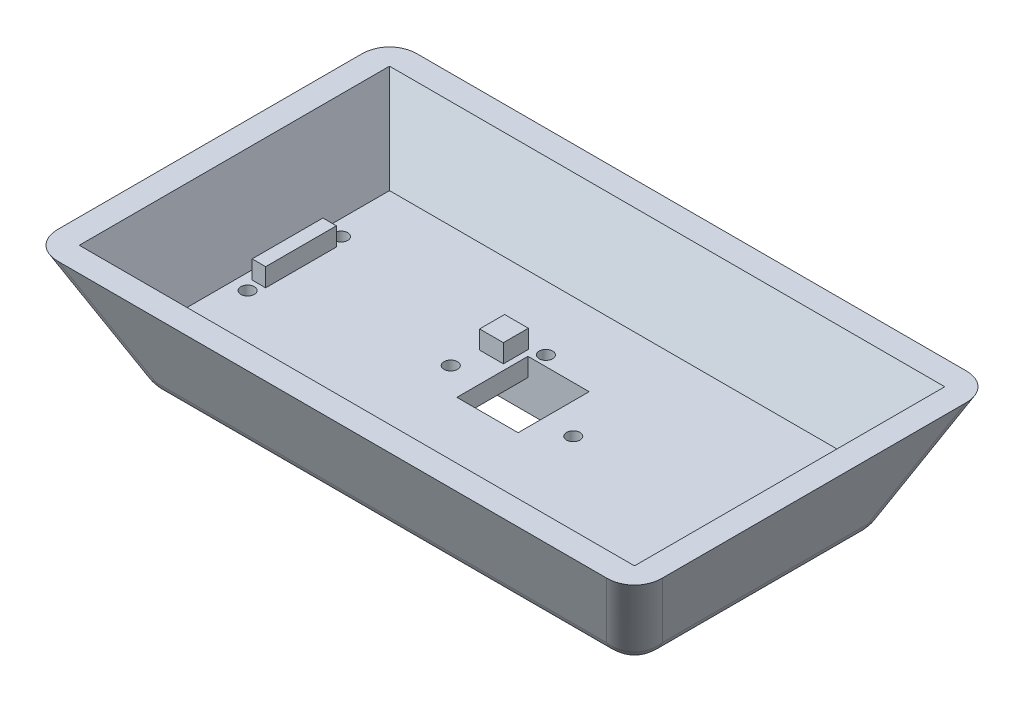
ISO-10303-21;
HEADER;
FILE_DESCRIPTION(('STEP AP214'),'2;1');
FILE_NAME('part.step','',(''),(''),'','','');
FILE_SCHEMA(('AUTOMOTIVE_DESIGN { 1 0 10303 214 1 1 1 1 }'));
ENDSEC;
DATA;
#1=APPLICATION_CONTEXT('core data for automotive mechanical design processes');
#2=APPLICATION_PROTOCOL_DEFINITION('international standard','automotive_design',2000,#1);
#3=PRODUCT_CONTEXT('',#1,'mechanical');
#4=PRODUCT('Part','Part','',(#3));
#5=PRODUCT_RELATED_PRODUCT_CATEGORY('part','',(#4));
#6=PRODUCT_DEFINITION_FORMATION('','',#4);
#7=PRODUCT_DEFINITION_CONTEXT('part definition',#1,'design');
#8=PRODUCT_DEFINITION('design','',#6,#7);
#9=PRODUCT_DEFINITION_SHAPE('','',#8);
#10=(LENGTH_UNIT() NAMED_UNIT(*) SI_UNIT(.MILLI.,.METRE.));
#11=(NAMED_UNIT(*) PLANE_ANGLE_UNIT() SI_UNIT($,.RADIAN.));
#12=(NAMED_UNIT(*) SI_UNIT($,.STERADIAN.) SOLID_ANGLE_UNIT());
#13=UNCERTAINTY_MEASURE_WITH_UNIT(LENGTH_MEASURE(1.E-05),#10,'distance_accuracy_value','');
#14=(GEOMETRIC_REPRESENTATION_CONTEXT(3) GLOBAL_UNCERTAINTY_ASSIGNED_CONTEXT((#13)) GLOBAL_UNIT_ASSIGNED_CONTEXT((#10,
#11,#12)) REPRESENTATION_CONTEXT('',''));
#15=CARTESIAN_POINT('',(0.,0.,0.));
#16=DIRECTION('',(0.,0.,1.));
#17=DIRECTION('',(1.,0.,0.));
#18=AXIS2_PLACEMENT_3D('',#15,#16,#17);
#19=CARTESIAN_POINT('',(0.,8.,0.));
#20=DIRECTION('',(0.,1.,0.));
#21=DIRECTION('',(0.,0.,1.));
#22=AXIS2_PLACEMENT_3D('',#19,#20,#21);
#23=PLANE('',#22);
#24=CARTESIAN_POINT('',(-3.73046126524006,8.,-9.26999999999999));
#25=DIRECTION('',(0.,1.,0.));
#26=DIRECTION('',(0.,0.,1.));
#27=AXIS2_PLACEMENT_3D('',#24,#25,#26);
#28=CIRCLE('',#27,1.1);
#29=CARTESIAN_POINT('',(-3.73046126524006,8.,-8.16999999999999));
#30=VERTEX_POINT('',#29);
#31=EDGE_CURVE('E307',#30,#30,#28,.T.);
#32=ORIENTED_EDGE('',*,*,#31,.F.);
#33=EDGE_LOOP('',(#32));
#34=FACE_BOUND('',#33,.T.);
#35=CARTESIAN_POINT('',(-37.19046126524,8.,5.98000000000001));
#36=DIRECTION('',(0.,1.,0.));
#37=DIRECTION('',(0.,0.,1.));
#38=AXIS2_PLACEMENT_3D('',#35,#36,#37);
#39=CIRCLE('',#38,1.1);
#40=CARTESIAN_POINT('',(-37.19046126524,8.,7.08));
#41=VERTEX_POINT('',#40);
#42=EDGE_CURVE('E300',#41,#41,#39,.T.);
#43=ORIENTED_EDGE('',*,*,#42,.F.);
#44=EDGE_LOOP('',(#43));
#45=FACE_BOUND('',#44,.T.);
#46=CARTESIAN_POINT('',(-37.1904612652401,8.,-9.26999999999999));
#47=DIRECTION('',(0.,1.,0.));
#48=DIRECTION('',(0.,0.,1.));
#49=AXIS2_PLACEMENT_3D('',#46,#47,#48);
#50=CIRCLE('',#49,1.1);
#51=CARTESIAN_POINT('',(-37.1904612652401,8.,-8.16999999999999));
#52=VERTEX_POINT('',#51);
#53=EDGE_CURVE('E303',#52,#52,#50,.T.);
#54=ORIENTED_EDGE('',*,*,#53,.F.);
#55=EDGE_LOOP('',(#54));
#56=FACE_BOUND('',#55,.T.);
#57=CARTESIAN_POINT('',(-10.,8.,0.));
#58=DIRECTION('',(0.,1.,0.));
#59=DIRECTION('',(0.,0.,1.));
#60=AXIS2_PLACEMENT_3D('',#57,#58,#59);
#61=CIRCLE('',#60,1.1);
#62=CARTESIAN_POINT('',(-10.,8.,1.1));
#63=VERTEX_POINT('',#62);
#64=EDGE_CURVE('E322',#63,#63,#61,.F.);
#65=ORIENTED_EDGE('',*,*,#64,.T.);
#66=EDGE_LOOP('',(#65));
#67=FACE_BOUND('',#66,.T.);
#68=CARTESIAN_POINT('',(10.,8.,0.));
#69=DIRECTION('',(0.,1.,0.));
#70=DIRECTION('',(0.,0.,1.));
#71=AXIS2_PLACEMENT_3D('',#68,#69,#70);
#72=CIRCLE('',#71,1.1);
#73=CARTESIAN_POINT('',(10.,8.,1.1));
#74=VERTEX_POINT('',#73);
#75=EDGE_CURVE('E325',#74,#74,#72,.F.);
#76=ORIENTED_EDGE('',*,*,#75,.T.);
#77=EDGE_LOOP('',(#76));
#78=FACE_BOUND('',#77,.T.);
#79=DIRECTION('',(0.,0.,-1.));
#80=VECTOR('',#79,1.);
#81=CARTESIAN_POINT('',(-5.,8.,4.));
#82=LINE('',#81,#80);
#83=CARTESIAN_POINT('',(-5.,8.,4.));
#84=VERTEX_POINT('',#83);
#85=CARTESIAN_POINT('',(-5.,8.,-7.6));
#86=VERTEX_POINT('',#85);
#87=EDGE_CURVE('E351',#84,#86,#82,.T.);
#88=ORIENTED_EDGE('',*,*,#87,.T.);
#89=DIRECTION('',(1.,0.,0.));
#90=VECTOR('',#89,1.);
#91=CARTESIAN_POINT('',(5.,8.,-7.6));
#92=LINE('',#91,#90);
#93=CARTESIAN_POINT('',(5.,8.,-7.6));
#94=VERTEX_POINT('',#93);
#95=EDGE_CURVE('E315',#86,#94,#92,.T.);
#96=ORIENTED_EDGE('',*,*,#95,.T.);
#97=DIRECTION('',(0.,0.,1.));
#98=VECTOR('',#97,1.);
#99=CARTESIAN_POINT('',(5.,8.,4.));
#100=LINE('',#99,#98);
#101=CARTESIAN_POINT('',(5.,8.,4.));
#102=VERTEX_POINT('',#101);
#103=EDGE_CURVE('E331',#94,#102,#100,.T.);
#104=ORIENTED_EDGE('',*,*,#103,.T.);
#105=DIRECTION('',(-1.,0.,0.));
#106=VECTOR('',#105,1.);
#107=CARTESIAN_POINT('',(5.,8.,4.));
#108=LINE('',#107,#106);
#109=EDGE_CURVE('E354',#102,#84,#108,.T.);
#110=ORIENTED_EDGE('',*,*,#109,.T.);
#111=EDGE_LOOP('',(#88,#96,#104,#110));
#112=FACE_BOUND('',#111,.T.);
#113=DIRECTION('',(-1.,0.,0.));
#114=VECTOR('',#113,1.);
#115=CARTESIAN_POINT('',(0.,8.,-19.73046126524));
#116=LINE('',#115,#114);
#117=CARTESIAN_POINT('',(39.73046126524,8.,-19.73046126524));
#118=VERTEX_POINT('',#117);
#119=CARTESIAN_POINT('',(-39.73046126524,8.,-19.73046126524));
#120=VERTEX_POINT('',#119);
#121=EDGE_CURVE('E369',#118,#120,#116,.T.);
#122=ORIENTED_EDGE('',*,*,#121,.T.);
#123=DIRECTION('',(0.,0.,1.));
#124=VECTOR('',#123,1.);
#125=CARTESIAN_POINT('',(-39.73046126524,8.,0.));
#126=LINE('',#125,#124);
#127=CARTESIAN_POINT('',(-39.73046126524,8.,19.73046126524));
#128=VERTEX_POINT('',#127);
#129=EDGE_CURVE('E383',#120,#128,#126,.T.);
#130=ORIENTED_EDGE('',*,*,#129,.T.);
#131=DIRECTION('',(1.,0.,0.));
#132=VECTOR('',#131,1.);
#133=CARTESIAN_POINT('',(0.,8.,19.73046126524));
#134=LINE('',#133,#132);
#135=CARTESIAN_POINT('',(39.73046126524,8.,19.73046126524));
#136=VERTEX_POINT('',#135);
#137=EDGE_CURVE('E386',#128,#136,#134,.T.);
#138=ORIENTED_EDGE('',*,*,#137,.T.);
#139=DIRECTION('',(0.,0.,-1.));
#140=VECTOR('',#139,1.);
#141=CARTESIAN_POINT('',(39.73046126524,8.,0.));
#142=LINE('',#141,#140);
#143=EDGE_CURVE('E378',#136,#118,#142,.T.);
#144=ORIENTED_EDGE('',*,*,#143,.T.);
#145=EDGE_LOOP('',(#122,#130,#138,#144));
#146=FACE_BOUND('',#145,.T.);
#147=DIRECTION('',(1.,0.,0.));
#148=VECTOR('',#147,1.);
#149=CARTESIAN_POINT('',(-38.29046126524,8.,4.13000000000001));
#150=LINE('',#149,#148);
#151=CARTESIAN_POINT('',(-38.29046126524,8.,4.13000000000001));
#152=VERTEX_POINT('',#151);
#153=CARTESIAN_POINT('',(-36.09046126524,8.,4.13000000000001));
#154=VERTEX_POINT('',#153);
#155=EDGE_CURVE('E263',#152,#154,#150,.T.);
#156=ORIENTED_EDGE('',*,*,#155,.F.);
#157=DIRECTION('',(0.,0.,1.));
#158=VECTOR('',#157,1.);
#159=CARTESIAN_POINT('',(-38.29046126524,8.,-7.41999999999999));
#160=LINE('',#159,#158);
#161=CARTESIAN_POINT('',(-38.29046126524,8.,-7.41999999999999));
#162=VERTEX_POINT('',#161);
#163=EDGE_CURVE('E260',#162,#152,#160,.T.);
#164=ORIENTED_EDGE('',*,*,#163,.F.);
#165=DIRECTION('',(-1.,0.,0.));
#166=VECTOR('',#165,1.);
#167=CARTESIAN_POINT('',(-38.29046126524,8.,-7.41999999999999));
#168=LINE('',#167,#166);
#169=CARTESIAN_POINT('',(-36.09046126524,8.,-7.41999999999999));
#170=VERTEX_POINT('',#169);
#171=EDGE_CURVE('E278',#170,#162,#168,.T.);
#172=ORIENTED_EDGE('',*,*,#171,.F.);
#173=DIRECTION('',(0.,0.,-1.));
#174=VECTOR('',#173,1.);
#175=CARTESIAN_POINT('',(-36.09046126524,8.,-7.41999999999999));
#176=LINE('',#175,#174);
#177=EDGE_CURVE('E286',#154,#170,#176,.T.);
#178=ORIENTED_EDGE('',*,*,#177,.F.);
#179=EDGE_LOOP('',(#156,#164,#172,#178));
#180=FACE_BOUND('',#179,.T.);
#181=DIRECTION('',(1.,0.,0.));
#182=VECTOR('',#181,1.);
#183=CARTESIAN_POINT('',(-9.81764741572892,8.,-4.53001605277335));
#184=LINE('',#183,#182);
#185=CARTESIAN_POINT('',(-9.81764741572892,8.,-4.53001605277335));
#186=VERTEX_POINT('',#185);
#187=CARTESIAN_POINT('',(-5.93586739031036,8.,-4.53001605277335));
#188=VERTEX_POINT('',#187);
#189=EDGE_CURVE('E259',#186,#188,#184,.T.);
#190=ORIENTED_EDGE('',*,*,#189,.F.);
#191=DIRECTION('',(0.,0.,1.));
#192=VECTOR('',#191,1.);
#193=CARTESIAN_POINT('',(-9.81764741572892,8.,-8.60917472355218));
#194=LINE('',#193,#192);
#195=CARTESIAN_POINT('',(-9.81764741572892,8.,-8.60917472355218));
#196=VERTEX_POINT('',#195);
#197=EDGE_CURVE('E254',#196,#186,#194,.T.);
#198=ORIENTED_EDGE('',*,*,#197,.F.);
#199=DIRECTION('',(-1.,0.,0.));
#200=VECTOR('',#199,1.);
#201=CARTESIAN_POINT('',(-9.81764741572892,8.,-8.60917472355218));
#202=LINE('',#201,#200);
#203=CARTESIAN_POINT('',(-5.93586739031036,8.,-8.60917472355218));
#204=VERTEX_POINT('',#203);
#205=EDGE_CURVE('E235',#204,#196,#202,.T.);
#206=ORIENTED_EDGE('',*,*,#205,.F.);
#207=DIRECTION('',(0.,0.,-1.));
#208=VECTOR('',#207,1.);
#209=CARTESIAN_POINT('',(-5.93586739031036,8.,-8.60917472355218));
#210=LINE('',#209,#208);
#211=EDGE_CURVE('E247',#188,#204,#210,.T.);
#212=ORIENTED_EDGE('',*,*,#211,.F.);
#213=EDGE_LOOP('',(#190,#198,#206,#212));
#214=FACE_BOUND('',#213,.T.);
#215=ADVANCED_FACE('F37',(#34,#45,#56,#67,#78,#112,#146,#180,#214),#23,.T.);
#216=CARTESIAN_POINT('',(40.,0.,-20.));
#217=DIRECTION('',(0.90630778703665,-0.4226182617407,0.));
#218=DIRECTION('',(0.4226182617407,0.90630778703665,0.));
#219=AXIS2_PLACEMENT_3D('',#216,#217,#218);
#220=PLANE('',#219);
#221=DIRECTION('',(0.,0.,1.));
#222=VECTOR('',#221,1.);
#223=CARTESIAN_POINT('',(49.3261531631,20.,-20.));
#224=LINE('',#223,#222);
#225=CARTESIAN_POINT('',(49.3261531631,20.,24.7946142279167));
#226=VERTEX_POINT('',#225);
#227=CARTESIAN_POINT('',(49.3261531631,20.,-24.7946142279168));
#228=VERTEX_POINT('',#227);
#229=EDGE_CURVE('E417',#226,#228,#224,.F.);
#230=ORIENTED_EDGE('',*,*,#229,.F.);
#231=DIRECTION('',(0.389281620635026,0.834817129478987,0.389281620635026));
#232=VECTOR('',#231,1.);
#233=CARTESIAN_POINT('',(34.6251030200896,-11.5265037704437,10.0935640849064));
#234=LINE('',#233,#232);
#235=CARTESIAN_POINT('',(41.3461876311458,2.8869086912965,16.8146486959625));
#236=VERTEX_POINT('',#235);
#237=EDGE_CURVE('E461',#226,#236,#234,.F.);
#238=ORIENTED_EDGE('',*,*,#237,.T.);
#239=DIRECTION('',(0.,0.,-1.));
#240=VECTOR('',#239,1.);
#241=CARTESIAN_POINT('',(41.3461876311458,2.8869086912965,-20.));
#242=LINE('',#241,#240);
#243=CARTESIAN_POINT('',(41.3461876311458,2.8869086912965,-16.8146486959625));
#244=VERTEX_POINT('',#243);
#245=EDGE_CURVE('E459',#236,#244,#242,.T.);
#246=ORIENTED_EDGE('',*,*,#245,.T.);
#247=DIRECTION('',(0.389281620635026,0.834817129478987,-0.389281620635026));
#248=VECTOR('',#247,1.);
#249=CARTESIAN_POINT('',(40.6867102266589,1.4726548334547,-16.1551712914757));
#250=LINE('',#249,#248);
#251=EDGE_CURVE('E457',#244,#228,#250,.T.);
#252=ORIENTED_EDGE('',*,*,#251,.T.);
#253=EDGE_LOOP('',(#230,#238,#246,#252));
#254=FACE_BOUND('',#253,.T.);
#255=ADVANCED_FACE('F530',(#254),#220,.T.);
#256=CARTESIAN_POINT('',(-40.,0.,-20.));
#257=DIRECTION('',(0.,-0.4226182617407,-0.90630778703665));
#258=DIRECTION('',(0.,0.90630778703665,-0.4226182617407));
#259=AXIS2_PLACEMENT_3D('',#256,#257,#258);
#260=PLANE('',#259);
#261=DIRECTION('',(1.,0.,0.));
#262=VECTOR('',#261,1.);
#263=CARTESIAN_POINT('',(-40.,20.,-29.3261531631));
#264=LINE('',#263,#262);
#265=CARTESIAN_POINT('',(44.7946142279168,20.,-29.3261531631));
#266=VERTEX_POINT('',#265);
#267=CARTESIAN_POINT('',(-44.7946142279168,20.,-29.3261531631));
#268=VERTEX_POINT('',#267);
#269=EDGE_CURVE('E426',#266,#268,#264,.F.);
#270=ORIENTED_EDGE('',*,*,#269,.F.);
#271=DIRECTION('',(0.389281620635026,0.834817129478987,-0.389281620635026));
#272=VECTOR('',#271,1.);
#273=CARTESIAN_POINT('',(24.0319568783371,-24.5256623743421,-8.56349581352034));
#274=LINE('',#273,#272);
#275=CARTESIAN_POINT('',(36.8146486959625,2.8869086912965,-21.3461876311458));
#276=VERTEX_POINT('',#275);
#277=EDGE_CURVE('E54',#266,#276,#274,.F.);
#278=ORIENTED_EDGE('',*,*,#277,.T.);
#279=DIRECTION('',(-1.,0.,0.));
#280=VECTOR('',#279,1.);
#281=CARTESIAN_POINT('',(-40.,2.8869086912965,-21.3461876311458));
#282=LINE('',#281,#280);
#283=CARTESIAN_POINT('',(-36.8146486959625,2.8869086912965,-21.3461876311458));
#284=VERTEX_POINT('',#283);
#285=EDGE_CURVE('E59',#276,#284,#282,.T.);
#286=ORIENTED_EDGE('',*,*,#285,.T.);
#287=DIRECTION('',(-0.389281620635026,0.834817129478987,-0.389281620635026));
#288=VECTOR('',#287,1.);
#289=CARTESIAN_POINT('',(-36.1551712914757,1.4726548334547,-20.6867102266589));
#290=LINE('',#289,#288);
#291=EDGE_CURVE('E463',#284,#268,#290,.T.);
#292=ORIENTED_EDGE('',*,*,#291,.T.);
#293=EDGE_LOOP('',(#270,#278,#286,#292));
#294=FACE_BOUND('',#293,.T.);
#295=ADVANCED_FACE('F537',(#294),#260,.T.);
#296=CARTESIAN_POINT('',(-40.,0.,-20.));
#297=DIRECTION('',(-0.90630778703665,-0.4226182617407,0.));
#298=DIRECTION('',(0.4226182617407,-0.90630778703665,0.));
#299=AXIS2_PLACEMENT_3D('',#296,#297,#298);
#300=PLANE('',#299);
#301=DIRECTION('',(0.,0.,1.));
#302=VECTOR('',#301,1.);
#303=CARTESIAN_POINT('',(-41.3461876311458,2.8869086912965,-20.));
#304=LINE('',#303,#302);
#305=CARTESIAN_POINT('',(-41.3461876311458,2.8869086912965,-16.8146486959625));
#306=VERTEX_POINT('',#305);
#307=CARTESIAN_POINT('',(-41.3461876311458,2.8869086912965,16.8146486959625));
#308=VERTEX_POINT('',#307);
#309=EDGE_CURVE('E437',#306,#308,#304,.T.);
#310=ORIENTED_EDGE('',*,*,#309,.T.);
#311=DIRECTION('',(-0.389281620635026,0.834817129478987,0.389281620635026));
#312=VECTOR('',#311,1.);
#313=CARTESIAN_POINT('',(-34.6251030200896,-11.5265037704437,10.0935640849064));
#314=LINE('',#313,#312);
#315=CARTESIAN_POINT('',(-49.3261531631,20.,24.7946142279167));
#316=VERTEX_POINT('',#315);
#317=EDGE_CURVE('E440',#308,#316,#314,.T.);
#318=ORIENTED_EDGE('',*,*,#317,.T.);
#319=DIRECTION('',(0.,0.,-1.));
#320=VECTOR('',#319,1.);
#321=CARTESIAN_POINT('',(-49.3261531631,20.,-20.));
#322=LINE('',#321,#320);
#323=CARTESIAN_POINT('',(-49.3261531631,20.,-24.7946142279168));
#324=VERTEX_POINT('',#323);
#325=EDGE_CURVE('E429',#324,#316,#322,.F.);
#326=ORIENTED_EDGE('',*,*,#325,.F.);
#327=DIRECTION('',(-0.389281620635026,0.834817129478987,-0.389281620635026));
#328=VECTOR('',#327,1.);
#329=CARTESIAN_POINT('',(-40.6867102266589,1.4726548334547,-16.1551712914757));
#330=LINE('',#329,#328);
#331=EDGE_CURVE('E435',#324,#306,#330,.F.);
#332=ORIENTED_EDGE('',*,*,#331,.T.);
#333=EDGE_LOOP('',(#310,#318,#326,#332));
#334=FACE_BOUND('',#333,.T.);
#335=ADVANCED_FACE('F594',(#334),#300,.T.);
#336=CARTESIAN_POINT('',(-40.,0.,20.));
#337=DIRECTION('',(0.,-0.4226182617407,0.90630778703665));
#338=DIRECTION('',(0.,-0.90630778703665,-0.4226182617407));
#339=AXIS2_PLACEMENT_3D('',#336,#337,#338);
#340=PLANE('',#339);
#341=DIRECTION('',(-1.,0.,0.));
#342=VECTOR('',#341,1.);
#343=CARTESIAN_POINT('',(-40.,20.,29.3261531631));
#344=LINE('',#343,#342);
#345=CARTESIAN_POINT('',(-44.7946142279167,20.,29.3261531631));
#346=VERTEX_POINT('',#345);
#347=CARTESIAN_POINT('',(44.7946142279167,20.,29.3261531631));
#348=VERTEX_POINT('',#347);
#349=EDGE_CURVE('E432',#346,#348,#344,.F.);
#350=ORIENTED_EDGE('',*,*,#349,.F.);
#351=DIRECTION('',(-0.389281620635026,0.834817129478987,0.389281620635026));
#352=VECTOR('',#351,1.);
#353=CARTESIAN_POINT('',(-36.1551712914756,1.4726548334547,20.6867102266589));
#354=LINE('',#353,#352);
#355=CARTESIAN_POINT('',(-36.8146486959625,2.8869086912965,21.3461876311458));
#356=VERTEX_POINT('',#355);
#357=EDGE_CURVE('E455',#346,#356,#354,.F.);
#358=ORIENTED_EDGE('',*,*,#357,.T.);
#359=DIRECTION('',(1.,0.,0.));
#360=VECTOR('',#359,1.);
#361=CARTESIAN_POINT('',(-40.,2.8869086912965,21.3461876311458));
#362=LINE('',#361,#360);
#363=CARTESIAN_POINT('',(36.8146486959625,2.8869086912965,21.3461876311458));
#364=VERTEX_POINT('',#363);
#365=EDGE_CURVE('E453',#356,#364,#362,.T.);
#366=ORIENTED_EDGE('',*,*,#365,.T.);
#367=DIRECTION('',(0.389281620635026,0.834817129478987,0.389281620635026));
#368=VECTOR('',#367,1.);
#369=CARTESIAN_POINT('',(24.0319568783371,-24.5256623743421,8.56349581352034));
#370=LINE('',#369,#368);
#371=EDGE_CURVE('E451',#364,#348,#370,.T.);
#372=ORIENTED_EDGE('',*,*,#371,.T.);
#373=EDGE_LOOP('',(#350,#358,#366,#372));
#374=FACE_BOUND('',#373,.T.);
#375=ADVANCED_FACE('F587',(#374),#340,.T.);
#376=CARTESIAN_POINT('',(0.,20.,0.));
#377=DIRECTION('',(0.,1.,0.));
#378=DIRECTION('',(0.,0.,1.));
#379=AXIS2_PLACEMENT_3D('',#376,#377,#378);
#380=PLANE('',#379);
#381=DIRECTION('',(-1.,0.,0.));
#382=VECTOR('',#381,1.);
#383=CARTESIAN_POINT('',(45.3261531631,20.,-25.3261531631));
#384=LINE('',#383,#382);
#385=CARTESIAN_POINT('',(45.3261531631,20.,-25.3261531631));
#386=VERTEX_POINT('',#385);
#387=CARTESIAN_POINT('',(-45.3261531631,20.,-25.3261531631));
#388=VERTEX_POINT('',#387);
#389=EDGE_CURVE('E321',#386,#388,#384,.T.);
#390=ORIENTED_EDGE('',*,*,#389,.F.);
#391=DIRECTION('',(0.,0.,-1.));
#392=VECTOR('',#391,1.);
#393=CARTESIAN_POINT('',(45.3261531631,20.,25.3261531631));
#394=LINE('',#393,#392);
#395=CARTESIAN_POINT('',(45.3261531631,20.,25.3261531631));
#396=VERTEX_POINT('',#395);
#397=EDGE_CURVE('E366',#396,#386,#394,.T.);
#398=ORIENTED_EDGE('',*,*,#397,.F.);
#399=DIRECTION('',(1.,0.,0.));
#400=VECTOR('',#399,1.);
#401=CARTESIAN_POINT('',(-45.3261531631,20.,25.3261531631));
#402=LINE('',#401,#400);
#403=CARTESIAN_POINT('',(-45.3261531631,20.,25.3261531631));
#404=VERTEX_POINT('',#403);
#405=EDGE_CURVE('E363',#404,#396,#402,.T.);
#406=ORIENTED_EDGE('',*,*,#405,.F.);
#407=DIRECTION('',(0.,0.,1.));
#408=VECTOR('',#407,1.);
#409=CARTESIAN_POINT('',(-45.3261531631,20.,-25.3261531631));
#410=LINE('',#409,#408);
#411=EDGE_CURVE('E360',#388,#404,#410,.T.);
#412=ORIENTED_EDGE('',*,*,#411,.F.);
#413=EDGE_LOOP('',(#390,#398,#406,#412));
#414=FACE_BOUND('',#413,.T.);
#415=ORIENTED_EDGE('',*,*,#325,.T.);
#416=CARTESIAN_POINT('',(-43.8092635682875,20.,23.8092635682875));
#417=DIRECTION('',(0.,1.,0.));
#418=DIRECTION('',(0.707106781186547,0.,-0.707106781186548));
#419=AXIS2_PLACEMENT_3D('',#416,#417,#418);
#420=ELLIPSE('',#419,5.98933565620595,5.);
#421=EDGE_CURVE('E11',#316,#346,#420,.T.);
#422=ORIENTED_EDGE('',*,*,#421,.T.);
#423=ORIENTED_EDGE('',*,*,#349,.T.);
#424=CARTESIAN_POINT('',(43.8092635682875,20.,23.8092635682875));
#425=DIRECTION('',(0.,1.,0.));
#426=DIRECTION('',(-0.707106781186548,0.,-0.707106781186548));
#427=AXIS2_PLACEMENT_3D('',#424,#425,#426);
#428=ELLIPSE('',#427,5.98933565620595,5.);
#429=EDGE_CURVE('E46',#348,#226,#428,.T.);
#430=ORIENTED_EDGE('',*,*,#429,.T.);
#431=ORIENTED_EDGE('',*,*,#229,.T.);
#432=CARTESIAN_POINT('',(43.8092635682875,20.,-23.8092635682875));
#433=DIRECTION('',(0.,1.,0.));
#434=DIRECTION('',(-0.707106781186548,0.,0.707106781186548));
#435=AXIS2_PLACEMENT_3D('',#432,#433,#434);
#436=ELLIPSE('',#435,5.98933565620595,5.);
#437=EDGE_CURVE('E469',#228,#266,#436,.T.);
#438=ORIENTED_EDGE('',*,*,#437,.T.);
#439=ORIENTED_EDGE('',*,*,#269,.T.);
#440=CARTESIAN_POINT('',(-43.8092635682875,20.,-23.8092635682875));
#441=DIRECTION('',(0.,1.,0.));
#442=DIRECTION('',(0.707106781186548,0.,0.707106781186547));
#443=AXIS2_PLACEMENT_3D('',#440,#441,#442);
#444=ELLIPSE('',#443,5.98933565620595,5.);
#445=EDGE_CURVE('E467',#268,#324,#444,.T.);
#446=ORIENTED_EDGE('',*,*,#445,.T.);
#447=EDGE_LOOP('',(#415,#422,#423,#430,#431,#438,#439,#446));
#448=FACE_BOUND('',#447,.T.);
#449=ADVANCED_FACE('F584',(#414,#448),#380,.T.);
#450=CARTESIAN_POINT('',(0.,0.,0.));
#451=DIRECTION('',(0.,1.,0.));
#452=DIRECTION('',(0.,0.,1.));
#453=AXIS2_PLACEMENT_3D('',#450,#451,#452);
#454=PLANE('',#453);
#455=DIRECTION('',(-1.,0.,0.));
#456=VECTOR('',#455,1.);
#457=CARTESIAN_POINT('',(0.,0.,16.8146486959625));
#458=LINE('',#457,#456);
#459=CARTESIAN_POINT('',(36.8146486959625,0.,16.8146486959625));
#460=VERTEX_POINT('',#459);
#461=CARTESIAN_POINT('',(-36.8146486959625,0.,16.8146486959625));
#462=VERTEX_POINT('',#461);
#463=EDGE_CURVE('E446',#460,#462,#458,.T.);
#464=ORIENTED_EDGE('',*,*,#463,.T.);
#465=DIRECTION('',(0.,0.,-1.));
#466=VECTOR('',#465,1.);
#467=CARTESIAN_POINT('',(-36.8146486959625,0.,0.));
#468=LINE('',#467,#466);
#469=CARTESIAN_POINT('',(-36.8146486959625,0.,-16.8146486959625));
#470=VERTEX_POINT('',#469);
#471=EDGE_CURVE('E448',#462,#470,#468,.T.);
#472=ORIENTED_EDGE('',*,*,#471,.T.);
#473=DIRECTION('',(1.,0.,0.));
#474=VECTOR('',#473,1.);
#475=CARTESIAN_POINT('',(0.,0.,-16.8146486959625));
#476=LINE('',#475,#474);
#477=CARTESIAN_POINT('',(36.8146486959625,0.,-16.8146486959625));
#478=VERTEX_POINT('',#477);
#479=EDGE_CURVE('E442',#470,#478,#476,.T.);
#480=ORIENTED_EDGE('',*,*,#479,.T.);
#481=DIRECTION('',(0.,0.,1.));
#482=VECTOR('',#481,1.);
#483=CARTESIAN_POINT('',(36.8146486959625,0.,0.));
#484=LINE('',#483,#482);
#485=EDGE_CURVE('E444',#478,#460,#484,.T.);
#486=ORIENTED_EDGE('',*,*,#485,.T.);
#487=EDGE_LOOP('',(#464,#472,#480,#486));
#488=FACE_BOUND('',#487,.T.);
#489=DIRECTION('',(-1.,0.,0.));
#490=VECTOR('',#489,1.);
#491=CARTESIAN_POINT('',(-15.1,0.,7.6));
#492=LINE('',#491,#490);
#493=CARTESIAN_POINT('',(15.1,0.,7.6));
#494=VERTEX_POINT('',#493);
#495=CARTESIAN_POINT('',(-15.1,0.,7.6));
#496=VERTEX_POINT('',#495);
#497=EDGE_CURVE('E407',#494,#496,#492,.T.);
#498=ORIENTED_EDGE('',*,*,#497,.F.);
#499=DIRECTION('',(0.,0.,1.));
#500=VECTOR('',#499,1.);
#501=CARTESIAN_POINT('',(15.1,0.,7.6));
#502=LINE('',#501,#500);
#503=CARTESIAN_POINT('',(15.1,0.,-7.6));
#504=VERTEX_POINT('',#503);
#505=EDGE_CURVE('E372',#504,#494,#502,.T.);
#506=ORIENTED_EDGE('',*,*,#505,.F.);
#507=DIRECTION('',(1.,0.,0.));
#508=VECTOR('',#507,1.);
#509=CARTESIAN_POINT('',(-15.1,0.,-7.6));
#510=LINE('',#509,#508);
#511=CARTESIAN_POINT('',(-15.1,0.,-7.6));
#512=VERTEX_POINT('',#511);
#513=EDGE_CURVE('E395',#512,#504,#510,.T.);
#514=ORIENTED_EDGE('',*,*,#513,.F.);
#515=DIRECTION('',(0.,0.,-1.));
#516=VECTOR('',#515,1.);
#517=CARTESIAN_POINT('',(-15.1,0.,7.6));
#518=LINE('',#517,#516);
#519=EDGE_CURVE('E410',#496,#512,#518,.T.);
#520=ORIENTED_EDGE('',*,*,#519,.F.);
#521=EDGE_LOOP('',(#498,#506,#514,#520));
#522=FACE_BOUND('',#521,.T.);
#523=ADVANCED_FACE('F582',(#488,#522),#454,.F.);
#524=CARTESIAN_POINT('',(15.1,5.,7.6));
#525=DIRECTION('',(1.,0.,0.));
#526=DIRECTION('',(0.,0.,-1.));
#527=AXIS2_PLACEMENT_3D('',#524,#525,#526);
#528=PLANE('',#527);
#529=ORIENTED_EDGE('',*,*,#505,.T.);
#530=DIRECTION('',(0.,-1.,0.));
#531=VECTOR('',#530,1.);
#532=CARTESIAN_POINT('',(15.1,5.,7.6));
#533=LINE('',#532,#531);
#534=CARTESIAN_POINT('',(15.1,5.,7.6));
#535=VERTEX_POINT('',#534);
#536=EDGE_CURVE('E405',#535,#494,#533,.T.);
#537=ORIENTED_EDGE('',*,*,#536,.F.);
#538=DIRECTION('',(0.,0.,1.));
#539=VECTOR('',#538,1.);
#540=CARTESIAN_POINT('',(15.1,5.,7.6));
#541=LINE('',#540,#539);
#542=CARTESIAN_POINT('',(15.1,5.,-7.6));
#543=VERTEX_POINT('',#542);
#544=EDGE_CURVE('E391',#543,#535,#541,.T.);
#545=ORIENTED_EDGE('',*,*,#544,.F.);
#546=DIRECTION('',(0.,-1.,0.));
#547=VECTOR('',#546,1.);
#548=CARTESIAN_POINT('',(15.1,5.,-7.6));
#549=LINE('',#548,#547);
#550=EDGE_CURVE('E415',#543,#504,#549,.T.);
#551=ORIENTED_EDGE('',*,*,#550,.T.);
#552=EDGE_LOOP('',(#529,#537,#545,#551));
#553=FACE_BOUND('',#552,.T.);
#554=ADVANCED_FACE('F572',(#553),#528,.F.);
#555=CARTESIAN_POINT('',(-15.1,5.,-7.6));
#556=DIRECTION('',(0.,0.,-1.));
#557=DIRECTION('',(-1.,0.,0.));
#558=AXIS2_PLACEMENT_3D('',#555,#556,#557);
#559=PLANE('',#558);
#560=ORIENTED_EDGE('',*,*,#513,.T.);
#561=ORIENTED_EDGE('',*,*,#550,.F.);
#562=DIRECTION('',(1.,0.,0.));
#563=VECTOR('',#562,1.);
#564=CARTESIAN_POINT('',(-15.1,5.,-7.6));
#565=LINE('',#564,#563);
#566=CARTESIAN_POINT('',(5.,5.,-7.6));
#567=VERTEX_POINT('',#566);
#568=EDGE_CURVE('E401',#567,#543,#565,.T.);
#569=ORIENTED_EDGE('',*,*,#568,.F.);
#570=DIRECTION('',(0.,-1.,0.));
#571=VECTOR('',#570,1.);
#572=CARTESIAN_POINT('',(5.,20.001,-7.6));
#573=LINE('',#572,#571);
#574=EDGE_CURVE('E338',#94,#567,#573,.T.);
#575=ORIENTED_EDGE('',*,*,#574,.F.);
#576=ORIENTED_EDGE('',*,*,#95,.F.);
#577=DIRECTION('',(0.,-1.,0.));
#578=VECTOR('',#577,1.);
#579=CARTESIAN_POINT('',(-5.,20.001,-7.6));
#580=LINE('',#579,#578);
#581=CARTESIAN_POINT('',(-5.,5.,-7.6));
#582=VERTEX_POINT('',#581);
#583=EDGE_CURVE('E335',#86,#582,#580,.T.);
#584=ORIENTED_EDGE('',*,*,#583,.T.);
#585=CARTESIAN_POINT('',(-15.1,5.,-7.6));
#586=VERTEX_POINT('',#585);
#587=EDGE_CURVE('E402',#586,#582,#565,.T.);
#588=ORIENTED_EDGE('',*,*,#587,.F.);
#589=DIRECTION('',(0.,-1.,0.));
#590=VECTOR('',#589,1.);
#591=CARTESIAN_POINT('',(-15.1,5.,-7.6));
#592=LINE('',#591,#590);
#593=EDGE_CURVE('E418',#586,#512,#592,.T.);
#594=ORIENTED_EDGE('',*,*,#593,.T.);
#595=EDGE_LOOP('',(#560,#561,#569,#575,#576,#584,#588,#594));
#596=FACE_BOUND('',#595,.T.);
#597=ADVANCED_FACE('F568',(#596),#559,.F.);
#598=CARTESIAN_POINT('',(-15.1,5.,7.6));
#599=DIRECTION('',(-1.,0.,0.));
#600=DIRECTION('',(0.,0.,1.));
#601=AXIS2_PLACEMENT_3D('',#598,#599,#600);
#602=PLANE('',#601);
#603=ORIENTED_EDGE('',*,*,#519,.T.);
#604=ORIENTED_EDGE('',*,*,#593,.F.);
#605=DIRECTION('',(0.,0.,-1.));
#606=VECTOR('',#605,1.);
#607=CARTESIAN_POINT('',(-15.1,5.,7.6));
#608=LINE('',#607,#606);
#609=CARTESIAN_POINT('',(-15.1,5.,7.6));
#610=VERTEX_POINT('',#609);
#611=EDGE_CURVE('E398',#610,#586,#608,.T.);
#612=ORIENTED_EDGE('',*,*,#611,.F.);
#613=DIRECTION('',(0.,-1.,0.));
#614=VECTOR('',#613,1.);
#615=CARTESIAN_POINT('',(-15.1,5.,7.6));
#616=LINE('',#615,#614);
#617=EDGE_CURVE('E420',#610,#496,#616,.T.);
#618=ORIENTED_EDGE('',*,*,#617,.T.);
#619=EDGE_LOOP('',(#603,#604,#612,#618));
#620=FACE_BOUND('',#619,.T.);
#621=ADVANCED_FACE('F571',(#620),#602,.F.);
#622=CARTESIAN_POINT('',(-15.1,5.,7.6));
#623=DIRECTION('',(0.,0.,1.));
#624=DIRECTION('',(1.,0.,0.));
#625=AXIS2_PLACEMENT_3D('',#622,#623,#624);
#626=PLANE('',#625);
#627=ORIENTED_EDGE('',*,*,#497,.T.);
#628=ORIENTED_EDGE('',*,*,#617,.F.);
#629=DIRECTION('',(-1.,0.,0.));
#630=VECTOR('',#629,1.);
#631=CARTESIAN_POINT('',(-15.1,5.,7.6));
#632=LINE('',#631,#630);
#633=EDGE_CURVE('E394',#535,#610,#632,.T.);
#634=ORIENTED_EDGE('',*,*,#633,.F.);
#635=ORIENTED_EDGE('',*,*,#536,.T.);
#636=EDGE_LOOP('',(#627,#628,#634,#635));
#637=FACE_BOUND('',#636,.T.);
#638=ADVANCED_FACE('F566',(#637),#626,.F.);
#639=CARTESIAN_POINT('',(0.,5.,0.));
#640=DIRECTION('',(0.,-1.,0.));
#641=DIRECTION('',(0.,0.,-1.));
#642=AXIS2_PLACEMENT_3D('',#639,#640,#641);
#643=PLANE('',#642);
#644=DIRECTION('',(0.,0.,-1.));
#645=VECTOR('',#644,1.);
#646=CARTESIAN_POINT('',(-5.,5.,4.));
#647=LINE('',#646,#645);
#648=CARTESIAN_POINT('',(-5.,5.,4.));
#649=VERTEX_POINT('',#648);
#650=EDGE_CURVE('E348',#649,#582,#647,.T.);
#651=ORIENTED_EDGE('',*,*,#650,.F.);
#652=DIRECTION('',(-1.,0.,0.));
#653=VECTOR('',#652,1.);
#654=CARTESIAN_POINT('',(5.,5.,4.));
#655=LINE('',#654,#653);
#656=CARTESIAN_POINT('',(5.,5.,4.));
#657=VERTEX_POINT('',#656);
#658=EDGE_CURVE('E337',#657,#649,#655,.T.);
#659=ORIENTED_EDGE('',*,*,#658,.F.);
#660=DIRECTION('',(0.,0.,1.));
#661=VECTOR('',#660,1.);
#662=CARTESIAN_POINT('',(5.,5.,4.));
#663=LINE('',#662,#661);
#664=EDGE_CURVE('E346',#567,#657,#663,.T.);
#665=ORIENTED_EDGE('',*,*,#664,.F.);
#666=ORIENTED_EDGE('',*,*,#568,.T.);
#667=ORIENTED_EDGE('',*,*,#544,.T.);
#668=ORIENTED_EDGE('',*,*,#633,.T.);
#669=ORIENTED_EDGE('',*,*,#611,.T.);
#670=ORIENTED_EDGE('',*,*,#587,.T.);
#671=EDGE_LOOP('',(#651,#659,#665,#666,#667,#668,#669,#670));
#672=FACE_BOUND('',#671,.T.);
#673=CARTESIAN_POINT('',(-10.,5.,0.));
#674=DIRECTION('',(0.,-1.,0.));
#675=DIRECTION('',(0.,0.,-1.));
#676=AXIS2_PLACEMENT_3D('',#673,#674,#675);
#677=CIRCLE('',#676,1.1);
#678=CARTESIAN_POINT('',(-10.,5.,-1.1));
#679=VERTEX_POINT('',#678);
#680=EDGE_CURVE('E318',#679,#679,#677,.T.);
#681=ORIENTED_EDGE('',*,*,#680,.F.);
#682=EDGE_LOOP('',(#681));
#683=FACE_BOUND('',#682,.T.);
#684=CARTESIAN_POINT('',(10.,5.,0.));
#685=DIRECTION('',(0.,-1.,0.));
#686=DIRECTION('',(0.,0.,-1.));
#687=AXIS2_PLACEMENT_3D('',#684,#685,#686);
#688=CIRCLE('',#687,1.1);
#689=CARTESIAN_POINT('',(10.,5.,-1.1));
#690=VERTEX_POINT('',#689);
#691=EDGE_CURVE('E328',#690,#690,#688,.T.);
#692=ORIENTED_EDGE('',*,*,#691,.F.);
#693=EDGE_LOOP('',(#692));
#694=FACE_BOUND('',#693,.T.);
#695=ADVANCED_FACE('F550',(#672,#683,#694),#643,.T.);
#696=CARTESIAN_POINT('',(45.3261531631,20.,-25.3261531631));
#697=DIRECTION('',(0.,-0.4226182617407,-0.906307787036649));
#698=DIRECTION('',(0.,0.90630778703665,-0.4226182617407));
#699=AXIS2_PLACEMENT_3D('',#696,#697,#698);
#700=PLANE('',#699);
#701=ORIENTED_EDGE('',*,*,#389,.T.);
#702=DIRECTION('',(-0.389281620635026,0.834817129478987,-0.389281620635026));
#703=VECTOR('',#702,1.);
#704=CARTESIAN_POINT('',(-31.5886863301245,-9.46009269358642,-11.5886863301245));
#705=LINE('',#704,#703);
#706=EDGE_CURVE('E374',#120,#388,#705,.T.);
#707=ORIENTED_EDGE('',*,*,#706,.F.);
#708=ORIENTED_EDGE('',*,*,#121,.F.);
#709=DIRECTION('',(0.389281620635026,0.834817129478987,-0.389281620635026));
#710=VECTOR('',#709,1.);
#711=CARTESIAN_POINT('',(37.6502935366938,3.53906591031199,-17.6502935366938));
#712=LINE('',#711,#710);
#713=EDGE_CURVE('E370',#118,#386,#712,.T.);
#714=ORIENTED_EDGE('',*,*,#713,.T.);
#715=EDGE_LOOP('',(#701,#707,#708,#714));
#716=FACE_BOUND('',#715,.T.);
#717=ADVANCED_FACE('F546',(#716),#700,.F.);
#718=CARTESIAN_POINT('',(45.3261531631,20.,25.3261531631));
#719=DIRECTION('',(0.90630778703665,-0.4226182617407,0.));
#720=DIRECTION('',(0.4226182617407,0.90630778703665,0.));
#721=AXIS2_PLACEMENT_3D('',#718,#719,#720);
#722=PLANE('',#721);
#723=ORIENTED_EDGE('',*,*,#397,.T.);
#724=ORIENTED_EDGE('',*,*,#713,.F.);
#725=ORIENTED_EDGE('',*,*,#143,.F.);
#726=DIRECTION('',(0.389281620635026,0.834817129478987,0.389281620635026));
#727=VECTOR('',#726,1.);
#728=CARTESIAN_POINT('',(31.5886863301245,-9.46009269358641,11.5886863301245));
#729=LINE('',#728,#727);
#730=EDGE_CURVE('E373',#136,#396,#729,.T.);
#731=ORIENTED_EDGE('',*,*,#730,.T.);
#732=EDGE_LOOP('',(#723,#724,#725,#731));
#733=FACE_BOUND('',#732,.T.);
#734=ADVANCED_FACE('F549',(#733),#722,.F.);
#735=CARTESIAN_POINT('',(-45.3261531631,20.,25.3261531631));
#736=DIRECTION('',(0.,-0.4226182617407,0.906307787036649));
#737=DIRECTION('',(0.,-0.90630778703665,-0.4226182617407));
#738=AXIS2_PLACEMENT_3D('',#735,#736,#737);
#739=PLANE('',#738);
#740=ORIENTED_EDGE('',*,*,#405,.T.);
#741=ORIENTED_EDGE('',*,*,#730,.F.);
#742=ORIENTED_EDGE('',*,*,#137,.F.);
#743=DIRECTION('',(-0.389281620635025,0.834817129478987,0.389281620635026));
#744=VECTOR('',#743,1.);
#745=CARTESIAN_POINT('',(-37.6502935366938,3.539065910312,17.6502935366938));
#746=LINE('',#745,#744);
#747=EDGE_CURVE('E377',#128,#404,#746,.T.);
#748=ORIENTED_EDGE('',*,*,#747,.T.);
#749=EDGE_LOOP('',(#740,#741,#742,#748));
#750=FACE_BOUND('',#749,.T.);
#751=ADVANCED_FACE('F556',(#750),#739,.F.);
#752=CARTESIAN_POINT('',(-45.3261531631,20.,-25.3261531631));
#753=DIRECTION('',(-0.90630778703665,-0.4226182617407,0.));
#754=DIRECTION('',(0.4226182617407,-0.90630778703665,0.));
#755=AXIS2_PLACEMENT_3D('',#752,#753,#754);
#756=PLANE('',#755);
#757=ORIENTED_EDGE('',*,*,#411,.T.);
#758=ORIENTED_EDGE('',*,*,#747,.F.);
#759=ORIENTED_EDGE('',*,*,#129,.F.);
#760=ORIENTED_EDGE('',*,*,#706,.T.);
#761=EDGE_LOOP('',(#757,#758,#759,#760));
#762=FACE_BOUND('',#761,.T.);
#763=ADVANCED_FACE('F552',(#762),#756,.F.);
#764=CARTESIAN_POINT('',(-5.,20.001,4.));
#765=DIRECTION('',(-1.,0.,0.));
#766=DIRECTION('',(0.,0.,1.));
#767=AXIS2_PLACEMENT_3D('',#764,#765,#766);
#768=PLANE('',#767);
#769=DIRECTION('',(0.,-1.,0.));
#770=VECTOR('',#769,1.);
#771=CARTESIAN_POINT('',(-5.,20.001,4.));
#772=LINE('',#771,#770);
#773=EDGE_CURVE('E334',#84,#649,#772,.T.);
#774=ORIENTED_EDGE('',*,*,#773,.T.);
#775=ORIENTED_EDGE('',*,*,#650,.T.);
#776=ORIENTED_EDGE('',*,*,#583,.F.);
#777=ORIENTED_EDGE('',*,*,#87,.F.);
#778=EDGE_LOOP('',(#774,#775,#776,#777));
#779=FACE_BOUND('',#778,.T.);
#780=ADVANCED_FACE('F555',(#779),#768,.F.);
#781=CARTESIAN_POINT('',(5.,20.001,4.));
#782=DIRECTION('',(0.,0.,1.));
#783=DIRECTION('',(1.,0.,0.));
#784=AXIS2_PLACEMENT_3D('',#781,#782,#783);
#785=PLANE('',#784);
#786=DIRECTION('',(0.,-1.,0.));
#787=VECTOR('',#786,1.);
#788=CARTESIAN_POINT('',(5.,20.001,4.));
#789=LINE('',#788,#787);
#790=EDGE_CURVE('E340',#102,#657,#789,.T.);
#791=ORIENTED_EDGE('',*,*,#790,.T.);
#792=ORIENTED_EDGE('',*,*,#658,.T.);
#793=ORIENTED_EDGE('',*,*,#773,.F.);
#794=ORIENTED_EDGE('',*,*,#109,.F.);
#795=EDGE_LOOP('',(#791,#792,#793,#794));
#796=FACE_BOUND('',#795,.T.);
#797=ADVANCED_FACE('F544',(#796),#785,.F.);
#798=CARTESIAN_POINT('',(5.,20.001,4.));
#799=DIRECTION('',(1.,0.,0.));
#800=DIRECTION('',(0.,0.,-1.));
#801=AXIS2_PLACEMENT_3D('',#798,#799,#800);
#802=PLANE('',#801);
#803=ORIENTED_EDGE('',*,*,#574,.T.);
#804=ORIENTED_EDGE('',*,*,#664,.T.);
#805=ORIENTED_EDGE('',*,*,#790,.F.);
#806=ORIENTED_EDGE('',*,*,#103,.F.);
#807=EDGE_LOOP('',(#803,#804,#805,#806));
#808=FACE_BOUND('',#807,.T.);
#809=ADVANCED_FACE('F692',(#808),#802,.F.);
#810=CARTESIAN_POINT('',(10.,20.001,0.));
#811=DIRECTION('',(0.,-1.,0.));
#812=DIRECTION('',(0.,0.,-1.));
#813=AXIS2_PLACEMENT_3D('',#810,#811,#812);
#814=CYLINDRICAL_SURFACE('',#813,1.1);
#815=ORIENTED_EDGE('',*,*,#75,.F.);
#816=EDGE_LOOP('',(#815));
#817=FACE_BOUND('',#816,.T.);
#818=ORIENTED_EDGE('',*,*,#691,.T.);
#819=EDGE_LOOP('',(#818));
#820=FACE_BOUND('',#819,.T.);
#821=ADVANCED_FACE('F703',(#817,#820),#814,.F.);
#822=CARTESIAN_POINT('',(-10.,20.001,0.));
#823=DIRECTION('',(0.,-1.,0.));
#824=DIRECTION('',(0.,0.,-1.));
#825=AXIS2_PLACEMENT_3D('',#822,#823,#824);
#826=CYLINDRICAL_SURFACE('',#825,1.1);
#827=ORIENTED_EDGE('',*,*,#64,.F.);
#828=EDGE_LOOP('',(#827));
#829=FACE_BOUND('',#828,.T.);
#830=ORIENTED_EDGE('',*,*,#680,.T.);
#831=EDGE_LOOP('',(#830));
#832=FACE_BOUND('',#831,.T.);
#833=ADVANCED_FACE('F710',(#829,#832),#826,.F.);
#834=CARTESIAN_POINT('',(-37.1904612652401,3.25,-9.26999999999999));
#835=DIRECTION('',(0.,1.,0.));
#836=DIRECTION('',(0.,0.,1.));
#837=AXIS2_PLACEMENT_3D('',#834,#835,#836);
#838=CYLINDRICAL_SURFACE('',#837,1.1);
#839=CARTESIAN_POINT('',(-37.1904612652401,3.25,-9.26999999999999));
#840=DIRECTION('',(0.,1.,0.));
#841=DIRECTION('',(0.,0.,1.));
#842=AXIS2_PLACEMENT_3D('',#839,#840,#841);
#843=CIRCLE('',#842,1.1);
#844=CARTESIAN_POINT('',(-37.1904612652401,3.25,-8.16999999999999));
#845=VERTEX_POINT('',#844);
#846=EDGE_CURVE('E312',#845,#845,#843,.T.);
#847=ORIENTED_EDGE('',*,*,#846,.F.);
#848=EDGE_LOOP('',(#847));
#849=FACE_BOUND('',#848,.T.);
#850=ORIENTED_EDGE('',*,*,#53,.T.);
#851=EDGE_LOOP('',(#850));
#852=FACE_BOUND('',#851,.T.);
#853=ADVANCED_FACE('F714',(#849,#852),#838,.F.);
#854=CARTESIAN_POINT('',(-37.1904612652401,3.25,-9.26999999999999));
#855=DIRECTION('',(0.,1.,0.));
#856=DIRECTION('',(0.,0.,1.));
#857=AXIS2_PLACEMENT_3D('',#854,#855,#856);
#858=PLANE('',#857);
#859=ORIENTED_EDGE('',*,*,#846,.T.);
#860=EDGE_LOOP('',(#859));
#861=FACE_BOUND('',#860,.T.);
#862=ADVANCED_FACE('F718',(#861),#858,.T.);
#863=CARTESIAN_POINT('',(-37.19046126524,3.25,5.98000000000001));
#864=DIRECTION('',(0.,1.,0.));
#865=DIRECTION('',(0.,0.,1.));
#866=AXIS2_PLACEMENT_3D('',#863,#864,#865);
#867=CYLINDRICAL_SURFACE('',#866,1.1);
#868=CARTESIAN_POINT('',(-37.19046126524,3.25,5.98000000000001));
#869=DIRECTION('',(0.,1.,0.));
#870=DIRECTION('',(0.,0.,1.));
#871=AXIS2_PLACEMENT_3D('',#868,#869,#870);
#872=CIRCLE('',#871,1.1);
#873=CARTESIAN_POINT('',(-37.19046126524,3.25,7.08));
#874=VERTEX_POINT('',#873);
#875=EDGE_CURVE('E304',#874,#874,#872,.T.);
#876=ORIENTED_EDGE('',*,*,#875,.F.);
#877=EDGE_LOOP('',(#876));
#878=FACE_BOUND('',#877,.T.);
#879=ORIENTED_EDGE('',*,*,#42,.T.);
#880=EDGE_LOOP('',(#879));
#881=FACE_BOUND('',#880,.T.);
#882=ADVANCED_FACE('F722',(#878,#881),#867,.F.);
#883=CARTESIAN_POINT('',(-37.19046126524,3.25,5.98000000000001));
#884=DIRECTION('',(0.,1.,0.));
#885=DIRECTION('',(0.,0.,1.));
#886=AXIS2_PLACEMENT_3D('',#883,#884,#885);
#887=PLANE('',#886);
#888=ORIENTED_EDGE('',*,*,#875,.T.);
#889=EDGE_LOOP('',(#888));
#890=FACE_BOUND('',#889,.T.);
#891=ADVANCED_FACE('F732',(#890),#887,.T.);
#892=CARTESIAN_POINT('',(-3.73046126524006,3.25,-9.26999999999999));
#893=DIRECTION('',(0.,1.,0.));
#894=DIRECTION('',(0.,0.,1.));
#895=AXIS2_PLACEMENT_3D('',#892,#893,#894);
#896=CYLINDRICAL_SURFACE('',#895,1.1);
#897=CARTESIAN_POINT('',(-3.73046126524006,3.25,-9.26999999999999));
#898=DIRECTION('',(0.,1.,0.));
#899=DIRECTION('',(0.,0.,1.));
#900=AXIS2_PLACEMENT_3D('',#897,#898,#899);
#901=CIRCLE('',#900,1.1);
#902=CARTESIAN_POINT('',(-3.73046126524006,3.25,-8.16999999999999));
#903=VERTEX_POINT('',#902);
#904=EDGE_CURVE('E299',#903,#903,#901,.T.);
#905=ORIENTED_EDGE('',*,*,#904,.F.);
#906=EDGE_LOOP('',(#905));
#907=FACE_BOUND('',#906,.T.);
#908=ORIENTED_EDGE('',*,*,#31,.T.);
#909=EDGE_LOOP('',(#908));
#910=FACE_BOUND('',#909,.T.);
#911=ADVANCED_FACE('F728',(#907,#910),#896,.F.);
#912=CARTESIAN_POINT('',(-3.73046126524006,3.25,-9.26999999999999));
#913=DIRECTION('',(0.,1.,0.));
#914=DIRECTION('',(0.,0.,1.));
#915=AXIS2_PLACEMENT_3D('',#912,#913,#914);
#916=PLANE('',#915);
#917=ORIENTED_EDGE('',*,*,#904,.T.);
#918=EDGE_LOOP('',(#917));
#919=FACE_BOUND('',#918,.T.);
#920=ADVANCED_FACE('F724',(#919),#916,.T.);
#921=CARTESIAN_POINT('',(-38.29046126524,11.,-7.41999999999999));
#922=DIRECTION('',(1.,0.,0.));
#923=DIRECTION('',(0.,0.,-1.));
#924=AXIS2_PLACEMENT_3D('',#921,#922,#923);
#925=PLANE('',#924);
#926=ORIENTED_EDGE('',*,*,#163,.T.);
#927=DIRECTION('',(0.,-1.,0.));
#928=VECTOR('',#927,1.);
#929=CARTESIAN_POINT('',(-38.29046126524,11.,4.13000000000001));
#930=LINE('',#929,#928);
#931=CARTESIAN_POINT('',(-38.29046126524,11.,4.13000000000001));
#932=VERTEX_POINT('',#931);
#933=EDGE_CURVE('E297',#932,#152,#930,.T.);
#934=ORIENTED_EDGE('',*,*,#933,.F.);
#935=DIRECTION('',(0.,0.,1.));
#936=VECTOR('',#935,1.);
#937=CARTESIAN_POINT('',(-38.29046126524,11.,-7.41999999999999));
#938=LINE('',#937,#936);
#939=CARTESIAN_POINT('',(-38.29046126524,11.,-7.41999999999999));
#940=VERTEX_POINT('',#939);
#941=EDGE_CURVE('E274',#940,#932,#938,.T.);
#942=ORIENTED_EDGE('',*,*,#941,.F.);
#943=DIRECTION('',(0.,-1.,0.));
#944=VECTOR('',#943,1.);
#945=CARTESIAN_POINT('',(-38.29046126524,11.,-7.41999999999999));
#946=LINE('',#945,#944);
#947=EDGE_CURVE('E283',#940,#162,#946,.T.);
#948=ORIENTED_EDGE('',*,*,#947,.T.);
#949=EDGE_LOOP('',(#926,#934,#942,#948));
#950=FACE_BOUND('',#949,.T.);
#951=ADVANCED_FACE('F727',(#950),#925,.F.);
#952=CARTESIAN_POINT('',(-38.29046126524,11.,4.13000000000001));
#953=DIRECTION('',(0.,0.,-1.));
#954=DIRECTION('',(-1.,0.,0.));
#955=AXIS2_PLACEMENT_3D('',#952,#953,#954);
#956=PLANE('',#955);
#957=ORIENTED_EDGE('',*,*,#155,.T.);
#958=DIRECTION('',(0.,-1.,0.));
#959=VECTOR('',#958,1.);
#960=CARTESIAN_POINT('',(-36.09046126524,11.,4.13000000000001));
#961=LINE('',#960,#959);
#962=CARTESIAN_POINT('',(-36.09046126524,11.,4.13000000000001));
#963=VERTEX_POINT('',#962);
#964=EDGE_CURVE('E294',#963,#154,#961,.T.);
#965=ORIENTED_EDGE('',*,*,#964,.F.);
#966=DIRECTION('',(1.,0.,0.));
#967=VECTOR('',#966,1.);
#968=CARTESIAN_POINT('',(-38.29046126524,11.,4.13000000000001));
#969=LINE('',#968,#967);
#970=EDGE_CURVE('E277',#932,#963,#969,.T.);
#971=ORIENTED_EDGE('',*,*,#970,.F.);
#972=ORIENTED_EDGE('',*,*,#933,.T.);
#973=EDGE_LOOP('',(#957,#965,#971,#972));
#974=FACE_BOUND('',#973,.T.);
#975=ADVANCED_FACE('F742',(#974),#956,.F.);
#976=CARTESIAN_POINT('',(-36.09046126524,11.,-7.41999999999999));
#977=DIRECTION('',(-1.,0.,0.));
#978=DIRECTION('',(0.,0.,1.));
#979=AXIS2_PLACEMENT_3D('',#976,#977,#978);
#980=PLANE('',#979);
#981=ORIENTED_EDGE('',*,*,#177,.T.);
#982=DIRECTION('',(0.,-1.,0.));
#983=VECTOR('',#982,1.);
#984=CARTESIAN_POINT('',(-36.09046126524,11.,-7.41999999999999));
#985=LINE('',#984,#983);
#986=CARTESIAN_POINT('',(-36.09046126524,11.,-7.41999999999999));
#987=VERTEX_POINT('',#986);
#988=EDGE_CURVE('E292',#987,#170,#985,.T.);
#989=ORIENTED_EDGE('',*,*,#988,.F.);
#990=DIRECTION('',(0.,0.,-1.));
#991=VECTOR('',#990,1.);
#992=CARTESIAN_POINT('',(-36.09046126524,11.,-7.41999999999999));
#993=LINE('',#992,#991);
#994=EDGE_CURVE('E280',#963,#987,#993,.T.);
#995=ORIENTED_EDGE('',*,*,#994,.F.);
#996=ORIENTED_EDGE('',*,*,#964,.T.);
#997=EDGE_LOOP('',(#981,#989,#995,#996));
#998=FACE_BOUND('',#997,.T.);
#999=ADVANCED_FACE('F746',(#998),#980,.F.);
#1000=CARTESIAN_POINT('',(-38.29046126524,11.,-7.41999999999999));
#1001=DIRECTION('',(0.,0.,1.));
#1002=DIRECTION('',(1.,0.,0.));
#1003=AXIS2_PLACEMENT_3D('',#1000,#1001,#1002);
#1004=PLANE('',#1003);
#1005=ORIENTED_EDGE('',*,*,#171,.T.);
#1006=ORIENTED_EDGE('',*,*,#947,.F.);
#1007=DIRECTION('',(-1.,0.,0.));
#1008=VECTOR('',#1007,1.);
#1009=CARTESIAN_POINT('',(-38.29046126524,11.,-7.41999999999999));
#1010=LINE('',#1009,#1008);
#1011=EDGE_CURVE('E282',#987,#940,#1010,.T.);
#1012=ORIENTED_EDGE('',*,*,#1011,.F.);
#1013=ORIENTED_EDGE('',*,*,#988,.T.);
#1014=EDGE_LOOP('',(#1005,#1006,#1012,#1013));
#1015=FACE_BOUND('',#1014,.T.);
#1016=ADVANCED_FACE('F750',(#1015),#1004,.F.);
#1017=CARTESIAN_POINT('',(0.,11.,0.));
#1018=DIRECTION('',(0.,1.,0.));
#1019=DIRECTION('',(0.,0.,1.));
#1020=AXIS2_PLACEMENT_3D('',#1017,#1018,#1019);
#1021=PLANE('',#1020);
#1022=ORIENTED_EDGE('',*,*,#941,.T.);
#1023=ORIENTED_EDGE('',*,*,#970,.T.);
#1024=ORIENTED_EDGE('',*,*,#994,.T.);
#1025=ORIENTED_EDGE('',*,*,#1011,.T.);
#1026=EDGE_LOOP('',(#1022,#1023,#1024,#1025));
#1027=FACE_BOUND('',#1026,.T.);
#1028=ADVANCED_FACE('F753',(#1027),#1021,.T.);
#1029=CARTESIAN_POINT('',(-9.81764741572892,11.,-8.60917472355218));
#1030=DIRECTION('',(1.,0.,0.));
#1031=DIRECTION('',(0.,0.,-1.));
#1032=AXIS2_PLACEMENT_3D('',#1029,#1030,#1031);
#1033=PLANE('',#1032);
#1034=ORIENTED_EDGE('',*,*,#197,.T.);
#1035=DIRECTION('',(0.,-1.,0.));
#1036=VECTOR('',#1035,1.);
#1037=CARTESIAN_POINT('',(-9.81764741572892,11.,-4.53001605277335));
#1038=LINE('',#1037,#1036);
#1039=CARTESIAN_POINT('',(-9.81764741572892,11.,-4.53001605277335));
#1040=VERTEX_POINT('',#1039);
#1041=EDGE_CURVE('E504',#1040,#186,#1038,.T.);
#1042=ORIENTED_EDGE('',*,*,#1041,.F.);
#1043=DIRECTION('',(0.,0.,1.));
#1044=VECTOR('',#1043,1.);
#1045=CARTESIAN_POINT('',(-9.81764741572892,11.,-8.60917472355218));
#1046=LINE('',#1045,#1044);
#1047=CARTESIAN_POINT('',(-9.81764741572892,11.,-8.60917472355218));
#1048=VERTEX_POINT('',#1047);
#1049=EDGE_CURVE('E248',#1048,#1040,#1046,.T.);
#1050=ORIENTED_EDGE('',*,*,#1049,.F.);
#1051=DIRECTION('',(0.,-1.,0.));
#1052=VECTOR('',#1051,1.);
#1053=CARTESIAN_POINT('',(-9.81764741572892,11.,-8.60917472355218));
#1054=LINE('',#1053,#1052);
#1055=EDGE_CURVE('E239',#1048,#196,#1054,.T.);
#1056=ORIENTED_EDGE('',*,*,#1055,.T.);
#1057=EDGE_LOOP('',(#1034,#1042,#1050,#1056));
#1058=FACE_BOUND('',#1057,.T.);
#1059=ADVANCED_FACE('F252',(#1058),#1033,.F.);
#1060=CARTESIAN_POINT('',(-9.81764741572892,11.,-4.53001605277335));
#1061=DIRECTION('',(0.,0.,-1.));
#1062=DIRECTION('',(-1.,0.,0.));
#1063=AXIS2_PLACEMENT_3D('',#1060,#1061,#1062);
#1064=PLANE('',#1063);
#1065=ORIENTED_EDGE('',*,*,#189,.T.);
#1066=DIRECTION('',(0.,-1.,0.));
#1067=VECTOR('',#1066,1.);
#1068=CARTESIAN_POINT('',(-5.93586739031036,11.,-4.53001605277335));
#1069=LINE('',#1068,#1067);
#1070=CARTESIAN_POINT('',(-5.93586739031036,11.,-4.53001605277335));
#1071=VERTEX_POINT('',#1070);
#1072=EDGE_CURVE('E506',#1071,#188,#1069,.T.);
#1073=ORIENTED_EDGE('',*,*,#1072,.F.);
#1074=DIRECTION('',(1.,0.,0.));
#1075=VECTOR('',#1074,1.);
#1076=CARTESIAN_POINT('',(-9.81764741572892,11.,-4.53001605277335));
#1077=LINE('',#1076,#1075);
#1078=EDGE_CURVE('E271',#1040,#1071,#1077,.T.);
#1079=ORIENTED_EDGE('',*,*,#1078,.F.);
#1080=ORIENTED_EDGE('',*,*,#1041,.T.);
#1081=EDGE_LOOP('',(#1065,#1073,#1079,#1080));
#1082=FACE_BOUND('',#1081,.T.);
#1083=ADVANCED_FACE('F516',(#1082),#1064,.F.);
#1084=CARTESIAN_POINT('',(-5.93586739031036,11.,-8.60917472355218));
#1085=DIRECTION('',(-1.,0.,0.));
#1086=DIRECTION('',(0.,0.,1.));
#1087=AXIS2_PLACEMENT_3D('',#1084,#1085,#1086);
#1088=PLANE('',#1087);
#1089=ORIENTED_EDGE('',*,*,#211,.T.);
#1090=DIRECTION('',(0.,-1.,0.));
#1091=VECTOR('',#1090,1.);
#1092=CARTESIAN_POINT('',(-5.93586739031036,11.,-8.60917472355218));
#1093=LINE('',#1092,#1091);
#1094=CARTESIAN_POINT('',(-5.93586739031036,11.,-8.60917472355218));
#1095=VERTEX_POINT('',#1094);
#1096=EDGE_CURVE('E242',#1095,#204,#1093,.T.);
#1097=ORIENTED_EDGE('',*,*,#1096,.F.);
#1098=DIRECTION('',(0.,0.,-1.));
#1099=VECTOR('',#1098,1.);
#1100=CARTESIAN_POINT('',(-5.93586739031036,11.,-8.60917472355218));
#1101=LINE('',#1100,#1099);
#1102=EDGE_CURVE('E269',#1071,#1095,#1101,.T.);
#1103=ORIENTED_EDGE('',*,*,#1102,.F.);
#1104=ORIENTED_EDGE('',*,*,#1072,.T.);
#1105=EDGE_LOOP('',(#1089,#1097,#1103,#1104));
#1106=FACE_BOUND('',#1105,.T.);
#1107=ADVANCED_FACE('F513',(#1106),#1088,.F.);
#1108=CARTESIAN_POINT('',(-9.81764741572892,11.,-8.60917472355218));
#1109=DIRECTION('',(0.,0.,1.));
#1110=DIRECTION('',(1.,0.,0.));
#1111=AXIS2_PLACEMENT_3D('',#1108,#1109,#1110);
#1112=PLANE('',#1111);
#1113=ORIENTED_EDGE('',*,*,#205,.T.);
#1114=ORIENTED_EDGE('',*,*,#1055,.F.);
#1115=DIRECTION('',(-1.,0.,0.));
#1116=VECTOR('',#1115,1.);
#1117=CARTESIAN_POINT('',(-9.81764741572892,11.,-8.60917472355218));
#1118=LINE('',#1117,#1116);
#1119=EDGE_CURVE('E257',#1095,#1048,#1118,.T.);
#1120=ORIENTED_EDGE('',*,*,#1119,.F.);
#1121=ORIENTED_EDGE('',*,*,#1096,.T.);
#1122=EDGE_LOOP('',(#1113,#1114,#1120,#1121));
#1123=FACE_BOUND('',#1122,.T.);
#1124=ADVANCED_FACE('F237',(#1123),#1112,.F.);
#1125=CARTESIAN_POINT('',(0.,11.,0.));
#1126=DIRECTION('',(0.,1.,0.));
#1127=DIRECTION('',(0.,0.,1.));
#1128=AXIS2_PLACEMENT_3D('',#1125,#1126,#1127);
#1129=PLANE('',#1128);
#1130=ORIENTED_EDGE('',*,*,#1049,.T.);
#1131=ORIENTED_EDGE('',*,*,#1078,.T.);
#1132=ORIENTED_EDGE('',*,*,#1102,.T.);
#1133=ORIENTED_EDGE('',*,*,#1119,.T.);
#1134=EDGE_LOOP('',(#1130,#1131,#1132,#1133));
#1135=FACE_BOUND('',#1134,.T.);
#1136=ADVANCED_FACE('F518',(#1135),#1129,.T.);
#1137=CARTESIAN_POINT('',(24.0319568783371,-22.4125710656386,-4.0319568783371));
#1138=DIRECTION('',(-0.389281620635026,-0.834817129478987,0.389281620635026));
#1139=DIRECTION('',(0.,-0.4226182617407,-0.90630778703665));
#1140=AXIS2_PLACEMENT_3D('',#1137,#1138,#1139);
#1141=CYLINDRICAL_SURFACE('',#1140,5.);
#1142=ORIENTED_EDGE('',*,*,#437,.F.);
#1143=ORIENTED_EDGE('',*,*,#251,.F.);
#1144=CARTESIAN_POINT('',(36.8146486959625,5.,-16.8146486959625));
#1145=DIRECTION('',(-0.389281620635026,-0.834817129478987,0.389281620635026));
#1146=DIRECTION('',(0.906307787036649,-0.422618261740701,0.));
#1147=AXIS2_PLACEMENT_3D('',#1144,#1145,#1146);
#1148=CIRCLE('',#1147,5.);
#1149=EDGE_CURVE('E499',#276,#244,#1148,.T.);
#1150=ORIENTED_EDGE('',*,*,#1149,.F.);
#1151=ORIENTED_EDGE('',*,*,#277,.F.);
#1152=EDGE_LOOP('',(#1142,#1143,#1150,#1151));
#1153=FACE_BOUND('',#1152,.T.);
#1154=ADVANCED_FACE('F39',(#1153),#1141,.T.);
#1155=CARTESIAN_POINT('',(30.0935640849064,-9.41341246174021,10.0935640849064));
#1156=DIRECTION('',(-0.389281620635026,-0.834817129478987,-0.389281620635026));
#1157=DIRECTION('',(0.,0.4226182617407,-0.90630778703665));
#1158=AXIS2_PLACEMENT_3D('',#1155,#1156,#1157);
#1159=CYLINDRICAL_SURFACE('',#1158,5.);
#1160=ORIENTED_EDGE('',*,*,#429,.F.);
#1161=ORIENTED_EDGE('',*,*,#371,.F.);
#1162=CARTESIAN_POINT('',(36.8146486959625,5.,16.8146486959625));
#1163=DIRECTION('',(-0.389281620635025,-0.834817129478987,-0.389281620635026));
#1164=DIRECTION('',(0.,0.422618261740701,-0.906307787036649));
#1165=AXIS2_PLACEMENT_3D('',#1162,#1163,#1164);
#1166=CIRCLE('',#1165,5.);
#1167=EDGE_CURVE('E497',#236,#364,#1166,.T.);
#1168=ORIENTED_EDGE('',*,*,#1167,.F.);
#1169=ORIENTED_EDGE('',*,*,#237,.F.);
#1170=EDGE_LOOP('',(#1160,#1161,#1168,#1169));
#1171=FACE_BOUND('',#1170,.T.);
#1172=ADVANCED_FACE('F525',(#1171),#1159,.T.);
#1173=CARTESIAN_POINT('',(36.8146486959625,5.,-20.));
#1174=DIRECTION('',(0.,0.,1.));
#1175=DIRECTION('',(1.,0.,0.));
#1176=AXIS2_PLACEMENT_3D('',#1173,#1174,#1175);
#1177=CYLINDRICAL_SURFACE('',#1176,5.);
#1178=CARTESIAN_POINT('',(36.8146486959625,5.,-16.8146486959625));
#1179=DIRECTION('',(0.,0.,-1.));
#1180=DIRECTION('',(0.,1.,0.));
#1181=AXIS2_PLACEMENT_3D('',#1178,#1179,#1180);
#1182=CIRCLE('',#1181,5.);
#1183=EDGE_CURVE('E41',#244,#478,#1182,.T.);
#1184=ORIENTED_EDGE('',*,*,#1183,.F.);
#1185=ORIENTED_EDGE('',*,*,#245,.F.);
#1186=CARTESIAN_POINT('',(36.8146486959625,5.,16.8146486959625));
#1187=DIRECTION('',(0.,0.,1.));
#1188=DIRECTION('',(1.,0.,0.));
#1189=AXIS2_PLACEMENT_3D('',#1186,#1187,#1188);
#1190=CIRCLE('',#1189,5.);
#1191=EDGE_CURVE('E494',#460,#236,#1190,.T.);
#1192=ORIENTED_EDGE('',*,*,#1191,.F.);
#1193=ORIENTED_EDGE('',*,*,#485,.F.);
#1194=EDGE_LOOP('',(#1184,#1185,#1192,#1193));
#1195=FACE_BOUND('',#1194,.T.);
#1196=ADVANCED_FACE('F636',(#1195),#1177,.T.);
#1197=CARTESIAN_POINT('',(36.8146486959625,5.,-16.8146486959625));
#1198=DIRECTION('',(0.,-1.,0.));
#1199=DIRECTION('',(0.,0.,-1.));
#1200=AXIS2_PLACEMENT_3D('',#1197,#1198,#1199);
#1201=SPHERICAL_SURFACE('',#1200,5.);
#1202=ORIENTED_EDGE('',*,*,#1149,.T.);
#1203=ORIENTED_EDGE('',*,*,#1183,.T.);
#1204=CARTESIAN_POINT('',(36.8146486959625,5.,-16.8146486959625));
#1205=DIRECTION('',(1.,0.,0.));
#1206=DIRECTION('',(0.,0.,-1.));
#1207=AXIS2_PLACEMENT_3D('',#1204,#1205,#1206);
#1208=CIRCLE('',#1207,5.);
#1209=EDGE_CURVE('E491',#276,#478,#1208,.F.);
#1210=ORIENTED_EDGE('',*,*,#1209,.F.);
#1211=EDGE_LOOP('',(#1202,#1203,#1210));
#1212=FACE_BOUND('',#1211,.T.);
#1213=ADVANCED_FACE('F632',(#1212),#1201,.T.);
#1214=CARTESIAN_POINT('',(36.8146486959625,5.,16.8146486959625));
#1215=DIRECTION('',(0.,-1.,0.));
#1216=DIRECTION('',(0.,0.,-1.));
#1217=AXIS2_PLACEMENT_3D('',#1214,#1215,#1216);
#1218=SPHERICAL_SURFACE('',#1217,5.);
#1219=ORIENTED_EDGE('',*,*,#1191,.T.);
#1220=ORIENTED_EDGE('',*,*,#1167,.T.);
#1221=CARTESIAN_POINT('',(36.8146486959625,5.,16.8146486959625));
#1222=DIRECTION('',(1.,0.,0.));
#1223=DIRECTION('',(0.,0.,-1.));
#1224=AXIS2_PLACEMENT_3D('',#1221,#1222,#1223);
#1225=CIRCLE('',#1224,5.);
#1226=EDGE_CURVE('E488',#460,#364,#1225,.F.);
#1227=ORIENTED_EDGE('',*,*,#1226,.F.);
#1228=EDGE_LOOP('',(#1219,#1220,#1227));
#1229=FACE_BOUND('',#1228,.T.);
#1230=ADVANCED_FACE('F628',(#1229),#1218,.T.);
#1231=CARTESIAN_POINT('',(-40.,5.,-16.8146486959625));
#1232=DIRECTION('',(1.,0.,0.));
#1233=DIRECTION('',(0.,0.,-1.));
#1234=AXIS2_PLACEMENT_3D('',#1231,#1232,#1233);
#1235=CYLINDRICAL_SURFACE('',#1234,5.);
#1236=ORIENTED_EDGE('',*,*,#1209,.T.);
#1237=ORIENTED_EDGE('',*,*,#479,.F.);
#1238=CARTESIAN_POINT('',(-36.8146486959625,5.,-16.8146486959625));
#1239=DIRECTION('',(-1.,0.,0.));
#1240=DIRECTION('',(0.,-1.,0.));
#1241=AXIS2_PLACEMENT_3D('',#1238,#1239,#1240);
#1242=CIRCLE('',#1241,5.);
#1243=EDGE_CURVE('E485',#284,#470,#1242,.T.);
#1244=ORIENTED_EDGE('',*,*,#1243,.F.);
#1245=ORIENTED_EDGE('',*,*,#285,.F.);
#1246=EDGE_LOOP('',(#1236,#1237,#1244,#1245));
#1247=FACE_BOUND('',#1246,.T.);
#1248=ADVANCED_FACE('F624',(#1247),#1235,.T.);
#1249=CARTESIAN_POINT('',(-36.1551712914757,3.5857461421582,-16.1551712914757));
#1250=DIRECTION('',(0.389281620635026,-0.834817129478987,0.389281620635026));
#1251=DIRECTION('',(0.90630778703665,0.4226182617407,0.));
#1252=AXIS2_PLACEMENT_3D('',#1249,#1250,#1251);
#1253=CYLINDRICAL_SURFACE('',#1252,5.);
#1254=ORIENTED_EDGE('',*,*,#445,.F.);
#1255=ORIENTED_EDGE('',*,*,#291,.F.);
#1256=CARTESIAN_POINT('',(-36.8146486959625,5.,-16.8146486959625));
#1257=DIRECTION('',(0.389281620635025,-0.834817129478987,0.389281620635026));
#1258=DIRECTION('',(0.,-0.422618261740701,-0.906307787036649));
#1259=AXIS2_PLACEMENT_3D('',#1256,#1257,#1258);
#1260=CIRCLE('',#1259,5.);
#1261=EDGE_CURVE('E482',#306,#284,#1260,.T.);
#1262=ORIENTED_EDGE('',*,*,#1261,.F.);
#1263=ORIENTED_EDGE('',*,*,#331,.F.);
#1264=EDGE_LOOP('',(#1254,#1255,#1262,#1263));
#1265=FACE_BOUND('',#1264,.T.);
#1266=ADVANCED_FACE('F620',(#1265),#1253,.T.);
#1267=CARTESIAN_POINT('',(-36.1551712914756,3.5857461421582,16.1551712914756));
#1268=DIRECTION('',(0.389281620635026,-0.834817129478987,-0.389281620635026));
#1269=DIRECTION('',(0.,0.4226182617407,-0.90630778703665));
#1270=AXIS2_PLACEMENT_3D('',#1267,#1268,#1269);
#1271=CYLINDRICAL_SURFACE('',#1270,5.);
#1272=ORIENTED_EDGE('',*,*,#421,.F.);
#1273=ORIENTED_EDGE('',*,*,#317,.F.);
#1274=CARTESIAN_POINT('',(-36.8146486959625,5.,16.8146486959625));
#1275=DIRECTION('',(0.389281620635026,-0.834817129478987,-0.389281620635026));
#1276=DIRECTION('',(0.906307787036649,0.422618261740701,0.));
#1277=AXIS2_PLACEMENT_3D('',#1274,#1275,#1276);
#1278=CIRCLE('',#1277,5.);
#1279=EDGE_CURVE('E479',#356,#308,#1278,.T.);
#1280=ORIENTED_EDGE('',*,*,#1279,.F.);
#1281=ORIENTED_EDGE('',*,*,#357,.F.);
#1282=EDGE_LOOP('',(#1272,#1273,#1280,#1281));
#1283=FACE_BOUND('',#1282,.T.);
#1284=ADVANCED_FACE('F616',(#1283),#1271,.T.);
#1285=CARTESIAN_POINT('',(-40.,5.,16.8146486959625));
#1286=DIRECTION('',(-1.,0.,0.));
#1287=DIRECTION('',(0.,0.,1.));
#1288=AXIS2_PLACEMENT_3D('',#1285,#1286,#1287);
#1289=CYLINDRICAL_SURFACE('',#1288,5.);
#1290=ORIENTED_EDGE('',*,*,#1226,.T.);
#1291=ORIENTED_EDGE('',*,*,#365,.F.);
#1292=CARTESIAN_POINT('',(-36.8146486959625,5.,16.8146486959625));
#1293=DIRECTION('',(-1.,0.,0.));
#1294=DIRECTION('',(0.,0.,1.));
#1295=AXIS2_PLACEMENT_3D('',#1292,#1293,#1294);
#1296=CIRCLE('',#1295,5.);
#1297=EDGE_CURVE('E476',#462,#356,#1296,.T.);
#1298=ORIENTED_EDGE('',*,*,#1297,.F.);
#1299=ORIENTED_EDGE('',*,*,#463,.F.);
#1300=EDGE_LOOP('',(#1290,#1291,#1298,#1299));
#1301=FACE_BOUND('',#1300,.T.);
#1302=ADVANCED_FACE('F612',(#1301),#1289,.T.);
#1303=CARTESIAN_POINT('',(-36.8146486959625,5.,-16.8146486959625));
#1304=DIRECTION('',(0.,-1.,0.));
#1305=DIRECTION('',(0.,0.,-1.));
#1306=AXIS2_PLACEMENT_3D('',#1303,#1304,#1305);
#1307=SPHERICAL_SURFACE('',#1306,5.);
#1308=ORIENTED_EDGE('',*,*,#1261,.T.);
#1309=ORIENTED_EDGE('',*,*,#1243,.T.);
#1310=CARTESIAN_POINT('',(-36.8146486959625,5.,-16.8146486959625));
#1311=DIRECTION('',(0.,0.,-1.));
#1312=DIRECTION('',(-1.,0.,0.));
#1313=AXIS2_PLACEMENT_3D('',#1310,#1311,#1312);
#1314=CIRCLE('',#1313,5.);
#1315=EDGE_CURVE('E474',#306,#470,#1314,.F.);
#1316=ORIENTED_EDGE('',*,*,#1315,.F.);
#1317=EDGE_LOOP('',(#1308,#1309,#1316));
#1318=FACE_BOUND('',#1317,.T.);
#1319=ADVANCED_FACE('F608',(#1318),#1307,.T.);
#1320=CARTESIAN_POINT('',(-36.8146486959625,5.,16.8146486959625));
#1321=DIRECTION('',(0.,-1.,0.));
#1322=DIRECTION('',(0.,0.,-1.));
#1323=AXIS2_PLACEMENT_3D('',#1320,#1321,#1322);
#1324=SPHERICAL_SURFACE('',#1323,5.);
#1325=ORIENTED_EDGE('',*,*,#1297,.T.);
#1326=ORIENTED_EDGE('',*,*,#1279,.T.);
#1327=CARTESIAN_POINT('',(-36.8146486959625,5.,16.8146486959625));
#1328=DIRECTION('',(0.,0.,1.));
#1329=DIRECTION('',(0.,-1.,0.));
#1330=AXIS2_PLACEMENT_3D('',#1327,#1328,#1329);
#1331=CIRCLE('',#1330,5.);
#1332=EDGE_CURVE('E472',#462,#308,#1331,.F.);
#1333=ORIENTED_EDGE('',*,*,#1332,.F.);
#1334=EDGE_LOOP('',(#1325,#1326,#1333));
#1335=FACE_BOUND('',#1334,.T.);
#1336=ADVANCED_FACE('F604',(#1335),#1324,.T.);
#1337=CARTESIAN_POINT('',(-36.8146486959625,5.,-20.));
#1338=DIRECTION('',(0.,0.,-1.));
#1339=DIRECTION('',(-1.,0.,0.));
#1340=AXIS2_PLACEMENT_3D('',#1337,#1338,#1339);
#1341=CYLINDRICAL_SURFACE('',#1340,5.);
#1342=ORIENTED_EDGE('',*,*,#1315,.T.);
#1343=ORIENTED_EDGE('',*,*,#471,.F.);
#1344=ORIENTED_EDGE('',*,*,#1332,.T.);
#1345=ORIENTED_EDGE('',*,*,#309,.F.);
#1346=EDGE_LOOP('',(#1342,#1343,#1344,#1345));
#1347=FACE_BOUND('',#1346,.T.);
#1348=ADVANCED_FACE('F601',(#1347),#1341,.T.);
#1349=CLOSED_SHELL('',(#215,#255,#295,#335,#375,#449,#523,#554,#597,#621,#638,#695,#717,#734,
#751,#763,#780,#797,#809,#821,#833,#853,#862,#882,#891,#911,#920,#951,#975,#999,#1016,#1028,
#1059,#1083,#1107,#1124,#1136,#1154,#1172,#1196,#1213,#1230,#1248,#1266,#1284,#1302,#1319,#1336,#1348));
#1350=MANIFOLD_SOLID_BREP('B2',#1349);
#1351=ADVANCED_BREP_SHAPE_REPRESENTATION('',(#18,#1350),#14);
#1352=SHAPE_DEFINITION_REPRESENTATION(#9,#1351);
ENDSEC;
END-ISO-10303-21;
